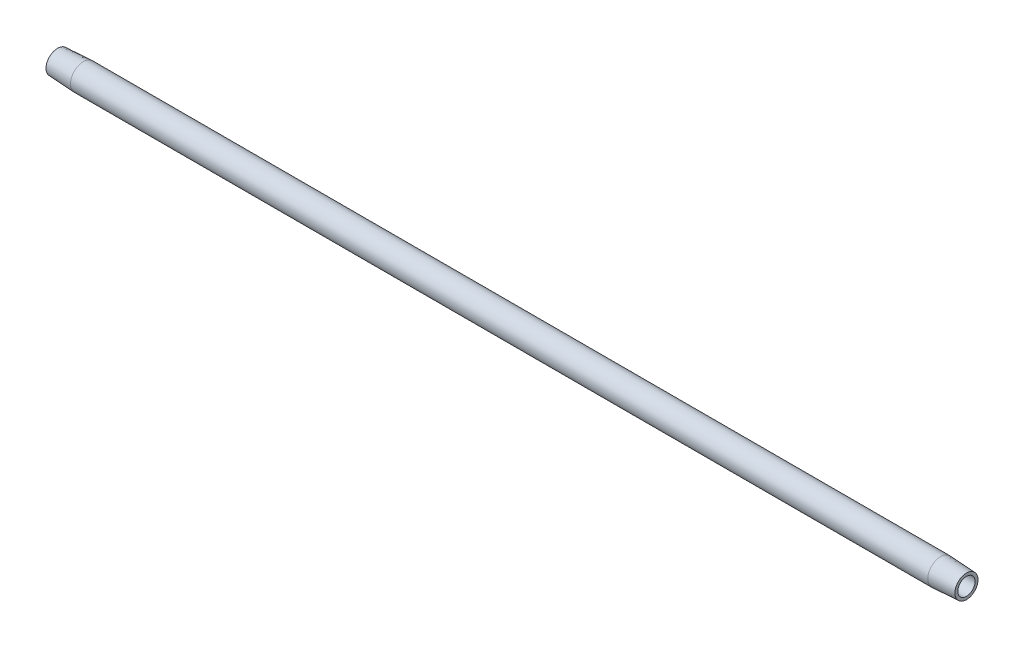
ISO-10303-21;
HEADER;
FILE_DESCRIPTION(('STEP AP214'),'2;1');
FILE_NAME('part.step','',(''),(''),'','','');
FILE_SCHEMA(('AUTOMOTIVE_DESIGN { 1 0 10303 214 1 1 1 1 }'));
ENDSEC;
DATA;
#1=APPLICATION_CONTEXT('core data for automotive mechanical design processes');
#2=APPLICATION_PROTOCOL_DEFINITION('international standard','automotive_design',2000,#1);
#3=PRODUCT_CONTEXT('',#1,'mechanical');
#4=PRODUCT('Part','Part','',(#3));
#5=PRODUCT_RELATED_PRODUCT_CATEGORY('part','',(#4));
#6=PRODUCT_DEFINITION_FORMATION('','',#4);
#7=PRODUCT_DEFINITION_CONTEXT('part definition',#1,'design');
#8=PRODUCT_DEFINITION('design','',#6,#7);
#9=PRODUCT_DEFINITION_SHAPE('','',#8);
#10=(LENGTH_UNIT() NAMED_UNIT(*) SI_UNIT(.MILLI.,.METRE.));
#11=(NAMED_UNIT(*) PLANE_ANGLE_UNIT() SI_UNIT($,.RADIAN.));
#12=(NAMED_UNIT(*) SI_UNIT($,.STERADIAN.) SOLID_ANGLE_UNIT());
#13=UNCERTAINTY_MEASURE_WITH_UNIT(LENGTH_MEASURE(1.E-05),#10,'distance_accuracy_value','');
#14=(GEOMETRIC_REPRESENTATION_CONTEXT(3) GLOBAL_UNCERTAINTY_ASSIGNED_CONTEXT((#13)) GLOBAL_UNIT_ASSIGNED_CONTEXT((#10,
#11,#12)) REPRESENTATION_CONTEXT('',''));
#15=CARTESIAN_POINT('',(0.,0.,0.));
#16=DIRECTION('',(0.,0.,1.));
#17=DIRECTION('',(1.,0.,0.));
#18=AXIS2_PLACEMENT_3D('',#15,#16,#17);
#19=CARTESIAN_POINT('',(0.476141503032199,0.,0.));
#20=DIRECTION('',(-1.,0.,0.));
#21=DIRECTION('',(0.,0.,1.));
#22=AXIS2_PLACEMENT_3D('',#19,#20,#21);
#23=CYLINDRICAL_SURFACE('',#22,3.96875);
#24=CARTESIAN_POINT('',(7.9375,0.,0.));
#25=DIRECTION('',(-1.,0.,0.));
#26=DIRECTION('',(0.,0.,1.));
#27=AXIS2_PLACEMENT_3D('',#24,#25,#26);
#28=CIRCLE('',#27,3.96875);
#29=CARTESIAN_POINT('',(7.9375,0.,3.96875));
#30=VERTEX_POINT('',#29);
#31=EDGE_CURVE('E10',#30,#30,#28,.T.);
#32=ORIENTED_EDGE('',*,*,#31,.F.);
#33=EDGE_LOOP('',(#32));
#34=FACE_BOUND('',#33,.T.);
#35=CARTESIAN_POINT('',(271.4625,0.,0.));
#36=DIRECTION('',(-1.,0.,0.));
#37=DIRECTION('',(0.,0.,1.));
#38=AXIS2_PLACEMENT_3D('',#35,#36,#37);
#39=CIRCLE('',#38,3.96875);
#40=CARTESIAN_POINT('',(271.4625,0.,3.96875));
#41=VERTEX_POINT('',#40);
#42=EDGE_CURVE('E52',#41,#41,#39,.T.);
#43=ORIENTED_EDGE('',*,*,#42,.T.);
#44=EDGE_LOOP('',(#43));
#45=FACE_BOUND('',#44,.T.);
#46=ADVANCED_FACE('F30',(#34,#45),#23,.T.);
#47=CARTESIAN_POINT('',(7.9375,0.,0.));
#48=DIRECTION('',(1.,0.,0.));
#49=DIRECTION('',(0.,0.,-1.));
#50=AXIS2_PLACEMENT_3D('',#47,#48,#49);
#51=CONICAL_SURFACE('',#50,3.96875,0.0523598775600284);
#52=CARTESIAN_POINT('',(0.,0.,0.));
#53=DIRECTION('',(-1.,0.,0.));
#54=DIRECTION('',(0.,0.,1.));
#55=AXIS2_PLACEMENT_3D('',#52,#53,#54);
#56=CIRCLE('',#55,3.55276325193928);
#57=CARTESIAN_POINT('',(0.,0.,3.55276325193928));
#58=VERTEX_POINT('',#57);
#59=EDGE_CURVE('E36',#58,#58,#56,.T.);
#60=ORIENTED_EDGE('',*,*,#59,.F.);
#61=EDGE_LOOP('',(#60));
#62=FACE_BOUND('',#61,.T.);
#63=ORIENTED_EDGE('',*,*,#31,.T.);
#64=EDGE_LOOP('',(#63));
#65=FACE_BOUND('',#64,.T.);
#66=ADVANCED_FACE('F77',(#62,#65),#51,.T.);
#67=CARTESIAN_POINT('',(0.,3.55276325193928,0.));
#68=DIRECTION('',(1.,0.,0.));
#69=DIRECTION('',(0.,0.,-1.));
#70=AXIS2_PLACEMENT_3D('',#67,#68,#69);
#71=PLANE('',#70);
#72=CARTESIAN_POINT('',(0.,0.,0.));
#73=DIRECTION('',(-1.,0.,0.));
#74=DIRECTION('',(0.,0.,1.));
#75=AXIS2_PLACEMENT_3D('',#72,#73,#74);
#76=CIRCLE('',#75,2.65429999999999);
#77=CARTESIAN_POINT('',(0.,0.,2.65429999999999));
#78=VERTEX_POINT('',#77);
#79=EDGE_CURVE('E40',#78,#78,#76,.T.);
#80=ORIENTED_EDGE('',*,*,#79,.F.);
#81=EDGE_LOOP('',(#80));
#82=FACE_BOUND('',#81,.T.);
#83=ORIENTED_EDGE('',*,*,#59,.T.);
#84=EDGE_LOOP('',(#83));
#85=FACE_BOUND('',#84,.T.);
#86=ADVANCED_FACE('F72',(#82,#85),#71,.F.);
#87=CARTESIAN_POINT('',(0.476141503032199,0.,0.));
#88=DIRECTION('',(-1.,0.,0.));
#89=DIRECTION('',(0.,0.,1.));
#90=AXIS2_PLACEMENT_3D('',#87,#88,#89);
#91=CYLINDRICAL_SURFACE('',#90,2.6543);
#92=CARTESIAN_POINT('',(279.4,0.,0.));
#93=DIRECTION('',(-1.,0.,0.));
#94=DIRECTION('',(0.,0.,1.));
#95=AXIS2_PLACEMENT_3D('',#92,#93,#94);
#96=CIRCLE('',#95,2.6543);
#97=CARTESIAN_POINT('',(279.4,0.,2.6543));
#98=VERTEX_POINT('',#97);
#99=EDGE_CURVE('E44',#98,#98,#96,.T.);
#100=ORIENTED_EDGE('',*,*,#99,.F.);
#101=EDGE_LOOP('',(#100));
#102=FACE_BOUND('',#101,.T.);
#103=ORIENTED_EDGE('',*,*,#79,.T.);
#104=EDGE_LOOP('',(#103));
#105=FACE_BOUND('',#104,.T.);
#106=ADVANCED_FACE('F66',(#102,#105),#91,.F.);
#107=CARTESIAN_POINT('',(279.4,2.6543,0.));
#108=DIRECTION('',(-1.,0.,0.));
#109=DIRECTION('',(0.,0.,1.));
#110=AXIS2_PLACEMENT_3D('',#107,#108,#109);
#111=PLANE('',#110);
#112=CARTESIAN_POINT('',(279.4,0.,0.));
#113=DIRECTION('',(-1.,0.,0.));
#114=DIRECTION('',(0.,0.,1.));
#115=AXIS2_PLACEMENT_3D('',#112,#113,#114);
#116=CIRCLE('',#115,3.55276325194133);
#117=CARTESIAN_POINT('',(279.4,0.,3.55276325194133));
#118=VERTEX_POINT('',#117);
#119=EDGE_CURVE('E49',#118,#118,#116,.T.);
#120=ORIENTED_EDGE('',*,*,#119,.F.);
#121=EDGE_LOOP('',(#120));
#122=FACE_BOUND('',#121,.T.);
#123=ORIENTED_EDGE('',*,*,#99,.T.);
#124=EDGE_LOOP('',(#123));
#125=FACE_BOUND('',#124,.T.);
#126=ADVANCED_FACE('F60',(#122,#125),#111,.F.);
#127=CARTESIAN_POINT('',(279.4,0.,0.));
#128=DIRECTION('',(-1.,0.,0.));
#129=DIRECTION('',(0.,0.,1.));
#130=AXIS2_PLACEMENT_3D('',#127,#128,#129);
#131=CONICAL_SURFACE('',#130,3.55276325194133,0.0523598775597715);
#132=ORIENTED_EDGE('',*,*,#42,.F.);
#133=EDGE_LOOP('',(#132));
#134=FACE_BOUND('',#133,.T.);
#135=ORIENTED_EDGE('',*,*,#119,.T.);
#136=EDGE_LOOP('',(#135));
#137=FACE_BOUND('',#136,.T.);
#138=ADVANCED_FACE('F57',(#134,#137),#131,.T.);
#139=CLOSED_SHELL('',(#46,#66,#86,#106,#126,#138));
#140=MANIFOLD_SOLID_BREP('B2',#139);
#141=ADVANCED_BREP_SHAPE_REPRESENTATION('',(#18,#140),#14);
#142=SHAPE_DEFINITION_REPRESENTATION(#9,#141);
ENDSEC;
END-ISO-10303-21;
